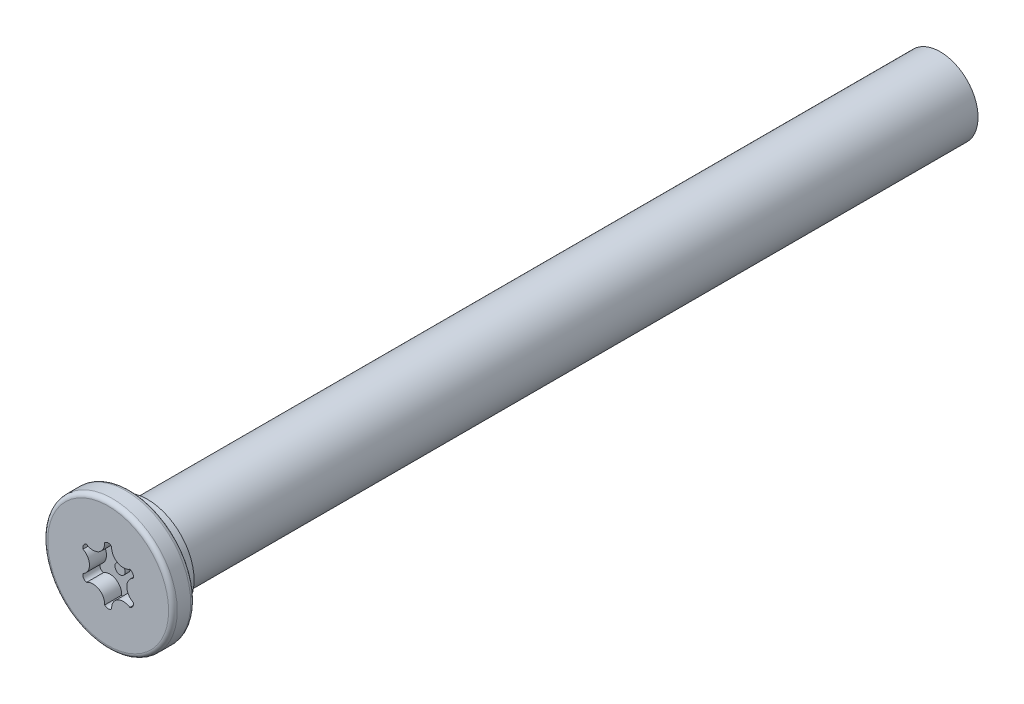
from build123d import *

# Parameters (mm, degrees)
SKETCH2_W           = 1.3
SKETCH2_H           = 3.81
SKETCH2_W_2         = 12.7
SKETCH2_H_2         = 2.23
CUT_EXTRUDE3_DEPTH  = 1
FILLET12_R          = 0.254
CUT_EXTRUDE6_START  = -12.7
SKETCH7_R           = 2.23
CUT_EXTRUDE6_DEPTH  = 12.7
SKETCH11_R          = 2.738000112
SKETCH11_R_2        = 2.230000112
BOSS_EXTRUDE1_DEPTH = 1.016
SKETCH12_R          = 2.230000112
BOSS_EXTRUDE2_DEPTH = 12.7
SKETCH14_R          = 0.3
BOSS_EXTRUDE4_DEPTH = 0.3
CUT_EXTRUDE7_START  = -12.7
SKETCH15_R          = 2.230000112
CUT_EXTRUDE7_DEPTH  = 12.7
SKETCH16_R          = 2.230000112
BOSS_EXTRUDE5_DEPTH = 47.625


with BuildPart() as part:
    # Sketch2 → Revolve1 (revolve)
    with BuildSketch(Plane(origin=(0, 0, 0), x_dir=(0, 0, -1), z_dir=(1, 0, 0)), mode=Mode.PRIVATE) as revolve1_sk:
        with Locations((0.65, 1.905)):
            Rectangle(SKETCH2_W, SKETCH2_H)
        with Locations((7.65, 1.115)):
            Rectangle(SKETCH2_W_2, SKETCH2_H_2)
    revolve(revolve1_sk.sketch.rotate(Axis((0, 0, -1.3), (0, 0, -1)), 90), axis=Axis((0, 0, -1.3), (0, 0, -1)))

    # Sketch3 → Cut-Extrude3 (cut)
    with BuildSketch(Plane.XY):
        with BuildLine():
            ThreePointArc((-0.205060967, 1.589373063), (0, 1.674312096), (0.205060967, 1.589373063))
            ThreePointArc((0.205060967, 1.589373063), (0.54882888, 0.950599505), (1.273906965, 0.972274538))
            ThreePointArc((1.273906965, 0.972274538), (1.449996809, 0.837156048), (1.478967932, 0.617098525))
            ThreePointArc((1.478967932, 0.617098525), (1.097657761, 0), (1.478967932, -0.617098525))
            ThreePointArc((1.478967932, -0.617098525), (1.449996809, -0.837156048), (1.273906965, -0.972274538))
            ThreePointArc((1.273906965, -0.972274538), (0.54882888, -0.950599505), (0.205060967, -1.589373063))
            ThreePointArc((0.205060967, -1.589373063), (0, -1.674312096), (-0.205060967, -1.589373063))
            ThreePointArc((-0.205060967, -1.589373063), (-0.54882888, -0.950599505), (-1.273906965, -0.972274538))
            ThreePointArc((-1.273906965, -0.972274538), (-1.449996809, -0.837156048), (-1.478967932, -0.617098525))
            ThreePointArc((-1.478967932, -0.617098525), (-1.097657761, 0), (-1.478967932, 0.617098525))
            ThreePointArc((-1.478967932, 0.617098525), (-1.449996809, 0.837156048), (-1.273906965, 0.972274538))
            ThreePointArc((-1.273906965, 0.972274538), (-0.54882888, 0.950599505), (-0.205060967, 1.589373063))
        make_face()
    extrude(amount=-CUT_EXTRUDE3_DEPTH, mode=Mode.SUBTRACT)

    # Fillet12
    fillet12_edges = [part.edges().sort_by_distance(p)[0] for p in [
        (-3.81, 0, 0),
        (-3.81, 0, -1.3),
    ]]
    fillet(fillet12_edges, radius=FILLET12_R)

    # Sketch7 → Cut-Extrude6 (cut)
    with BuildSketch(Plane(origin=(0, 0, -14), x_dir=(-1, 0, 0), z_dir=(0, 0, -1)).offset(CUT_EXTRUDE6_START)):
        Circle(SKETCH7_R)
    extrude(amount=CUT_EXTRUDE6_DEPTH, mode=Mode.SUBTRACT)

    # Sketch11 → Boss-Extrude1 (add)
    with BuildSketch(Plane(origin=(0, 0, -1.3), x_dir=(-1, 0, 0), z_dir=(0, 0, -1))):
        with Locations(Location((0, 0, 0), (0, 0, 180))):
            Circle(SKETCH11_R)
        Circle(SKETCH11_R_2, mode=Mode.SUBTRACT)
    extrude(amount=BOSS_EXTRUDE1_DEPTH)

    # Sketch12 → Boss-Extrude2 (add)
    with BuildSketch(Plane(origin=(0, 0, -1.3), x_dir=(-1, 0, 0), z_dir=(0, 0, -1))):
        Circle(SKETCH12_R)
    extrude(amount=BOSS_EXTRUDE2_DEPTH)

    # Sketch14 → Boss-Extrude4 (add)
    with BuildSketch(Plane.XY.offset(-1)):
        Circle(SKETCH14_R)
    extrude(amount=BOSS_EXTRUDE4_DEPTH)

    # Sketch15 → Cut-Extrude7 (cut)
    with BuildSketch(Plane(origin=(0, 0, -14), x_dir=(-1, 0, 0), z_dir=(0, 0, -1)).offset(CUT_EXTRUDE7_START)):
        Circle(SKETCH15_R)
    extrude(amount=CUT_EXTRUDE7_DEPTH, mode=Mode.SUBTRACT)

    # Sketch16 → Boss-Extrude5 (add)
    with BuildSketch(Plane(origin=(0, 0, -1.3), x_dir=(-1, 0, 0), z_dir=(0, 0, -1))):
        Circle(SKETCH16_R)
    extrude(amount=BOSS_EXTRUDE5_DEPTH)


solid = part.part
